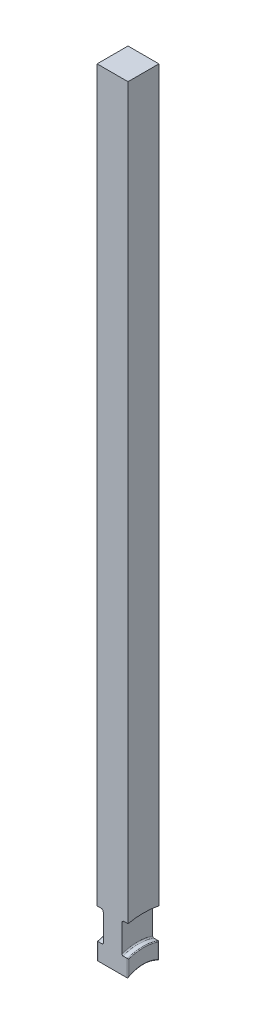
ISO-10303-21;
HEADER;
FILE_DESCRIPTION(('STEP AP214'),'2;1');
FILE_NAME('part.step','',(''),(''),'','','');
FILE_SCHEMA(('AUTOMOTIVE_DESIGN { 1 0 10303 214 1 1 1 1 }'));
ENDSEC;
DATA;
#1=APPLICATION_CONTEXT('core data for automotive mechanical design processes');
#2=APPLICATION_PROTOCOL_DEFINITION('international standard','automotive_design',2000,#1);
#3=PRODUCT_CONTEXT('',#1,'mechanical');
#4=PRODUCT('Part','Part','',(#3));
#5=PRODUCT_RELATED_PRODUCT_CATEGORY('part','',(#4));
#6=PRODUCT_DEFINITION_FORMATION('','',#4);
#7=PRODUCT_DEFINITION_CONTEXT('part definition',#1,'design');
#8=PRODUCT_DEFINITION('design','',#6,#7);
#9=PRODUCT_DEFINITION_SHAPE('','',#8);
#10=(LENGTH_UNIT() NAMED_UNIT(*) SI_UNIT(.MILLI.,.METRE.));
#11=(NAMED_UNIT(*) PLANE_ANGLE_UNIT() SI_UNIT($,.RADIAN.));
#12=(NAMED_UNIT(*) SI_UNIT($,.STERADIAN.) SOLID_ANGLE_UNIT());
#13=UNCERTAINTY_MEASURE_WITH_UNIT(LENGTH_MEASURE(1.E-05),#10,'distance_accuracy_value','');
#14=(GEOMETRIC_REPRESENTATION_CONTEXT(3) GLOBAL_UNCERTAINTY_ASSIGNED_CONTEXT((#13)) GLOBAL_UNIT_ASSIGNED_CONTEXT((#10,
#11,#12)) REPRESENTATION_CONTEXT('',''));
#15=CARTESIAN_POINT('',(0.,0.,0.));
#16=DIRECTION('',(0.,0.,1.));
#17=DIRECTION('',(1.,0.,0.));
#18=AXIS2_PLACEMENT_3D('',#15,#16,#17);
#19=CARTESIAN_POINT('',(5.,260.,5.));
#20=DIRECTION('',(0.,0.,-1.));
#21=DIRECTION('',(0.,1.,0.));
#22=AXIS2_PLACEMENT_3D('',#19,#20,#21);
#23=PLANE('',#22);
#24=DIRECTION('',(1.,0.,0.));
#25=VECTOR('',#24,1.);
#26=CARTESIAN_POINT('',(-5.,8.6602540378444,4.99999999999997));
#27=LINE('',#26,#25);
#28=CARTESIAN_POINT('',(-4.75,8.6602540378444,4.99999999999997));
#29=VERTEX_POINT('',#28);
#30=CARTESIAN_POINT('',(4.75,8.6602540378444,4.99999999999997));
#31=VERTEX_POINT('',#30);
#32=EDGE_CURVE('E212',#29,#31,#27,.T.);
#33=ORIENTED_EDGE('',*,*,#32,.T.);
#34=DIRECTION('',(0.,-1.,0.));
#35=VECTOR('',#34,1.);
#36=CARTESIAN_POINT('',(4.75,260.,5.));
#37=LINE('',#36,#35);
#38=CARTESIAN_POINT('',(4.75,14.142135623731,4.99999999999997));
#39=VERTEX_POINT('',#38);
#40=EDGE_CURVE('E513',#31,#39,#37,.F.);
#41=ORIENTED_EDGE('',*,*,#40,.T.);
#42=DIRECTION('',(-1.,0.,0.));
#43=VECTOR('',#42,1.);
#44=CARTESIAN_POINT('',(-8.84822894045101,14.142135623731,4.99999999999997));
#45=LINE('',#44,#43);
#46=CARTESIAN_POINT('',(3.381,14.142135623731,4.99999999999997));
#47=VERTEX_POINT('',#46);
#48=EDGE_CURVE('E525',#47,#39,#45,.F.);
#49=ORIENTED_EDGE('',*,*,#48,.F.);
#50=CARTESIAN_POINT('',(3.381,14.142135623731,4.99999999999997));
#51=CARTESIAN_POINT('',(3.36044101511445,14.1421123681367,4.99999999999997));
#52=CARTESIAN_POINT('',(3.33989480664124,14.1438990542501,4.99999999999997));
#53=CARTESIAN_POINT('',(3.29944640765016,14.150911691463,4.99999999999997));
#54=CARTESIAN_POINT('',(3.27954279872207,14.1561294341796,4.99999999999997));
#55=CARTESIAN_POINT('',(3.24089644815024,14.1698244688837,4.99999999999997));
#56=CARTESIAN_POINT('',(3.22215359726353,14.1783014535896,4.99999999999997));
#57=CARTESIAN_POINT('',(3.18630692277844,14.1982079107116,4.99999999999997));
#58=CARTESIAN_POINT('',(3.16920356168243,14.2096382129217,4.99999999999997));
#59=CARTESIAN_POINT('',(3.13665043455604,14.2353899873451,4.99999999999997));
#60=CARTESIAN_POINT('',(3.12125112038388,14.2497751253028,4.99999999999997));
#61=CARTESIAN_POINT('',(3.09293401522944,14.2808084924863,4.99999999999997));
#62=CARTESIAN_POINT('',(3.08001687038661,14.2974573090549,4.99999999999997));
#63=CARTESIAN_POINT('',(3.05629123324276,14.3335018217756,4.99999999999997));
#64=CARTESIAN_POINT('',(3.0456345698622,14.3529973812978,4.99999999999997));
#65=CARTESIAN_POINT('',(3.02756329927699,14.393438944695,4.99999999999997));
#66=CARTESIAN_POINT('',(3.02014920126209,14.4143851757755,4.99999999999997));
#67=CARTESIAN_POINT('',(3.00963126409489,14.4536794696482,4.99999999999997));
#68=CARTESIAN_POINT('',(3.00602178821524,14.4718944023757,4.99999999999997));
#69=CARTESIAN_POINT('',(3.00120597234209,14.5086131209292,4.99999999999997));
#70=CARTESIAN_POINT('',(2.99999624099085,14.5271164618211,4.99999999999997));
#71=CARTESIAN_POINT('',(3.,14.5456234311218,4.99999999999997));
#72=B_SPLINE_CURVE_WITH_KNOTS('',3,(#50,#51,#52,#53,#54,#55,#56,#57,#58,#59,#60,#61,#62,#63,#64,
#65,#66,#67,#68,#69,#70,#71),.UNSPECIFIED.,.F.,.F.,(4,2,2,2,2,2,2,2,2,2,4),(0.,
0.061579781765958,0.123012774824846,0.18443997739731,0.245884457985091,0.308826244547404,
0.371784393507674,0.438147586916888,0.504521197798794,0.560074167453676,0.615548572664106),.UNSPECIFIED.);
#73=CARTESIAN_POINT('',(3.,14.5456234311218,4.99999999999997));
#74=VERTEX_POINT('',#73);
#75=EDGE_CURVE('E312',#47,#74,#72,.T.);
#76=ORIENTED_EDGE('',*,*,#75,.T.);
#77=DIRECTION('',(0.,-1.,0.));
#78=VECTOR('',#77,1.);
#79=CARTESIAN_POINT('',(3.,260.,5.));
#80=LINE('',#79,#78);
#81=CARTESIAN_POINT('',(3.,23.2054442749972,4.99999999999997));
#82=VERTEX_POINT('',#81);
#83=EDGE_CURVE('E424',#82,#74,#80,.T.);
#84=ORIENTED_EDGE('',*,*,#83,.F.);
#85=CARTESIAN_POINT('',(3.,23.2054442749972,4.99999999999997));
#86=CARTESIAN_POINT('',(2.99996676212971,23.2499972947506,4.99999999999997));
#87=CARTESIAN_POINT('',(3.00373228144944,23.2945461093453,4.99999999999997));
#88=CARTESIAN_POINT('',(3.01862949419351,23.3823910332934,4.99999999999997));
#89=CARTESIAN_POINT('',(3.02976052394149,23.4256872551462,4.99999999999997));
#90=CARTESIAN_POINT('',(3.05916829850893,23.509822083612,4.99999999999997));
#91=CARTESIAN_POINT('',(3.07745028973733,23.5506588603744,4.99999999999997));
#92=CARTESIAN_POINT('',(3.12067837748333,23.6286229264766,4.99999999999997));
#93=CARTESIAN_POINT('',(3.14562195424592,23.6657516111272,4.99999999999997));
#94=CARTESIAN_POINT('',(3.2012013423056,23.7347915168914,4.99999999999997));
#95=CARTESIAN_POINT('',(3.23177053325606,23.7667563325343,4.99999999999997));
#96=CARTESIAN_POINT('',(3.29795305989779,23.8249730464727,4.99999999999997));
#97=CARTESIAN_POINT('',(3.33356714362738,23.8512240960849,4.99999999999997));
#98=CARTESIAN_POINT('',(3.40801970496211,23.8966720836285,4.99999999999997));
#99=CARTESIAN_POINT('',(3.44677552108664,23.9160046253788,4.99999999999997));
#100=CARTESIAN_POINT('',(3.5270132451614,23.9477326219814,4.99999999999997));
#101=CARTESIAN_POINT('',(3.56849266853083,23.9601343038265,4.99999999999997));
#102=CARTESIAN_POINT('',(3.63558702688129,23.9740235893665,4.99999999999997));
#103=CARTESIAN_POINT('',(3.66073087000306,23.9779013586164,4.99999999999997));
#104=CARTESIAN_POINT('',(3.71124579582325,23.9830736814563,4.99999999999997));
#105=CARTESIAN_POINT('',(3.7366164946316,23.9843719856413,4.99999999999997));
#106=CARTESIAN_POINT('',(3.762,23.9843699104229,4.99999999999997));
#107=B_SPLINE_CURVE_WITH_KNOTS('',3,(#85,#86,#87,#88,#89,#90,#91,#92,#93,#94,#95,#96,#97,#98,
#99,#100,#101,#102,#103,#104,#105,#106),.UNSPECIFIED.,.F.,.F.,(4,2,2,2,2,2,2,2,2,2,4),(0.,
0.133495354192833,0.266978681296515,0.40056012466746,0.53409111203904,0.6661321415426,
0.798192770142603,0.927501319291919,1.05669350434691,1.13289667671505,1.20898896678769),.UNSPECIFIED.);
#108=CARTESIAN_POINT('',(3.762,23.9843699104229,4.99999999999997));
#109=VERTEX_POINT('',#108);
#110=EDGE_CURVE('E277',#82,#109,#107,.T.);
#111=ORIENTED_EDGE('',*,*,#110,.T.);
#112=DIRECTION('',(-1.,0.,0.));
#113=VECTOR('',#112,1.);
#114=CARTESIAN_POINT('',(-8.84822894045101,23.9843699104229,4.99999999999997));
#115=LINE('',#114,#113);
#116=CARTESIAN_POINT('',(5.00000000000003,23.9843699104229,4.99999999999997));
#117=VERTEX_POINT('',#116);
#118=EDGE_CURVE('E482',#117,#109,#115,.T.);
#119=ORIENTED_EDGE('',*,*,#118,.F.);
#120=DIRECTION('',(0.,-1.,0.));
#121=VECTOR('',#120,1.);
#122=CARTESIAN_POINT('',(5.,260.,5.));
#123=LINE('',#122,#121);
#124=CARTESIAN_POINT('',(5.,260.,5.));
#125=VERTEX_POINT('',#124);
#126=EDGE_CURVE('E434',#125,#117,#123,.T.);
#127=ORIENTED_EDGE('',*,*,#126,.F.);
#128=DIRECTION('',(-1.,0.,0.));
#129=VECTOR('',#128,1.);
#130=CARTESIAN_POINT('',(5.,260.,5.));
#131=LINE('',#130,#129);
#132=CARTESIAN_POINT('',(-5.,260.,5.));
#133=VERTEX_POINT('',#132);
#134=EDGE_CURVE('E206',#125,#133,#131,.T.);
#135=ORIENTED_EDGE('',*,*,#134,.T.);
#136=DIRECTION('',(0.,-1.,0.));
#137=VECTOR('',#136,1.);
#138=CARTESIAN_POINT('',(-5.,260.,5.));
#139=LINE('',#138,#137);
#140=CARTESIAN_POINT('',(-5.00000000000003,23.9843699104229,4.99999999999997));
#141=VERTEX_POINT('',#140);
#142=EDGE_CURVE('E198',#133,#141,#139,.T.);
#143=ORIENTED_EDGE('',*,*,#142,.T.);
#144=DIRECTION('',(-1.,0.,0.));
#145=VECTOR('',#144,1.);
#146=CARTESIAN_POINT('',(-8.84822894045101,23.9843699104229,4.99999999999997));
#147=LINE('',#146,#145);
#148=CARTESIAN_POINT('',(-3.762,23.9843699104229,4.99999999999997));
#149=VERTEX_POINT('',#148);
#150=EDGE_CURVE('E179',#149,#141,#147,.T.);
#151=ORIENTED_EDGE('',*,*,#150,.F.);
#152=CARTESIAN_POINT('',(-3.762,23.9843699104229,4.99999999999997));
#153=CARTESIAN_POINT('',(-3.71978958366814,23.9844099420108,4.99999999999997));
#154=CARTESIAN_POINT('',(-3.67759522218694,23.9807897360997,4.99999999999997));
#155=CARTESIAN_POINT('',(-3.59446661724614,23.9665304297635,4.99999999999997));
#156=CARTESIAN_POINT('',(-3.55353072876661,23.9559009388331,4.99999999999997));
#157=CARTESIAN_POINT('',(-3.47401404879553,23.9279192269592,4.99999999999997));
#158=CARTESIAN_POINT('',(-3.4354339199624,23.9105651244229,4.99999999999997));
#159=CARTESIAN_POINT('',(-3.36170074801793,23.8696860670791,4.99999999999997));
#160=CARTESIAN_POINT('',(-3.32654766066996,23.846161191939,4.99999999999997));
#161=CARTESIAN_POINT('',(-3.26030425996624,23.7934071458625,4.99999999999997));
#162=CARTESIAN_POINT('',(-3.22925316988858,23.7641287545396,4.99999999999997));
#163=CARTESIAN_POINT('',(-3.17238517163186,23.7008610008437,4.99999999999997));
#164=CARTESIAN_POINT('',(-3.14656943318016,23.6668705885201,4.99999999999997));
#165=CARTESIAN_POINT('',(-3.10035493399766,23.5944221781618,4.99999999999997));
#166=CARTESIAN_POINT('',(-3.0800757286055,23.5558879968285,4.99999999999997));
#167=CARTESIAN_POINT('',(-3.04613526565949,23.4760125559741,4.99999999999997));
#168=CARTESIAN_POINT('',(-3.03247223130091,23.4346720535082,4.99999999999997));
#169=CARTESIAN_POINT('',(-3.01487304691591,23.3618958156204,4.99999999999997));
#170=CARTESIAN_POINT('',(-3.0092983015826,23.3308452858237,4.99999999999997));
#171=CARTESIAN_POINT('',(-3.00186183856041,23.2683479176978,4.99999999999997));
#172=CARTESIAN_POINT('',(-2.9999948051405,23.2369017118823,4.99999999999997));
#173=CARTESIAN_POINT('',(-3.,23.2054442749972,4.99999999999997));
#174=B_SPLINE_CURVE_WITH_KNOTS('',3,(#152,#153,#154,#155,#156,#157,#158,#159,#160,#161,#162,
#163,#164,#165,#166,#167,#168,#169,#170,#171,#172,#173),.UNSPECIFIED.,.F.,.F.,(4,2,2,2,2,2,2,2,
2,2,4),(0.,0.126452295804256,0.25273158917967,0.379046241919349,0.50535926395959,
0.632804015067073,0.760277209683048,0.89031743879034,1.02032272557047,1.11475319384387,
1.20904817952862),.UNSPECIFIED.);
#175=CARTESIAN_POINT('',(-3.,23.2054442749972,4.99999999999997));
#176=VERTEX_POINT('',#175);
#177=EDGE_CURVE('E243',#149,#176,#174,.T.);
#178=ORIENTED_EDGE('',*,*,#177,.T.);
#179=DIRECTION('',(0.,1.,0.));
#180=VECTOR('',#179,1.);
#181=CARTESIAN_POINT('',(-3.,260.,5.));
#182=LINE('',#181,#180);
#183=CARTESIAN_POINT('',(-3.,14.5456234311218,4.99999999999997));
#184=VERTEX_POINT('',#183);
#185=EDGE_CURVE('E428',#184,#176,#182,.T.);
#186=ORIENTED_EDGE('',*,*,#185,.F.);
#187=CARTESIAN_POINT('',(-3.,14.5456234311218,4.99999999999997));
#188=CARTESIAN_POINT('',(-2.99998669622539,14.521929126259,4.99999999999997));
#189=CARTESIAN_POINT('',(-3.00197620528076,14.4982335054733,4.99999999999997));
#190=CARTESIAN_POINT('',(-3.00986486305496,14.4514801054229,4.99999999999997));
#191=CARTESIAN_POINT('',(-3.01576760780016,14.4284229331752,4.99999999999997));
#192=CARTESIAN_POINT('',(-3.03139415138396,14.3836107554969,4.99999999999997));
#193=CARTESIAN_POINT('',(-3.04112173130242,14.3618570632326,4.99999999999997));
#194=CARTESIAN_POINT('',(-3.06418438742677,14.3203644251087,4.99999999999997));
#195=CARTESIAN_POINT('',(-3.07751717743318,14.3006242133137,4.99999999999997));
#196=CARTESIAN_POINT('',(-3.10707013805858,14.2643232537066,4.99999999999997));
#197=CARTESIAN_POINT('',(-3.12320168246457,14.2476904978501,4.99999999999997));
#198=CARTESIAN_POINT('',(-3.15817938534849,14.2175591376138,4.99999999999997));
#199=CARTESIAN_POINT('',(-3.17702556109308,14.2040605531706,4.99999999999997));
#200=CARTESIAN_POINT('',(-3.21576938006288,14.1813954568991,4.99999999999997));
#201=CARTESIAN_POINT('',(-3.23555118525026,14.1720306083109,4.99999999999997));
#202=CARTESIAN_POINT('',(-3.27645260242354,14.1569716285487,4.99999999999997));
#203=CARTESIAN_POINT('',(-3.29757019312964,14.1512720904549,4.99999999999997));
#204=CARTESIAN_POINT('',(-3.32924424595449,14.145729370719,4.99999999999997));
#205=CARTESIAN_POINT('',(-3.33955687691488,14.1443822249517,4.99999999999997));
#206=CARTESIAN_POINT('',(-3.36024450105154,14.1425859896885,4.99999999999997));
#207=CARTESIAN_POINT('',(-3.37061937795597,14.1421355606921,4.99999999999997));
#208=CARTESIAN_POINT('',(-3.38099999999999,14.1421356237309,4.99999999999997));
#209=B_SPLINE_CURVE_WITH_KNOTS('',3,(#187,#188,#189,#190,#191,#192,#193,#194,#195,#196,#197,
#198,#199,#200,#201,#202,#203,#204,#205,#206,#207,#208),.UNSPECIFIED.,.F.,.F.,(4,2,2,2,2,2,2,2,
2,2,4),(0.,0.0710029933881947,0.14207132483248,0.213210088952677,0.284303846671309,
0.353459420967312,0.422615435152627,0.487945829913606,0.553179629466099,0.584346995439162,
0.615467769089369),.UNSPECIFIED.);
#210=CARTESIAN_POINT('',(-3.381,14.142135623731,4.99999999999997));
#211=VERTEX_POINT('',#210);
#212=EDGE_CURVE('E292',#184,#211,#209,.T.);
#213=ORIENTED_EDGE('',*,*,#212,.T.);
#214=DIRECTION('',(-1.,0.,0.));
#215=VECTOR('',#214,1.);
#216=CARTESIAN_POINT('',(-8.84822894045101,14.142135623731,4.99999999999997));
#217=LINE('',#216,#215);
#218=CARTESIAN_POINT('',(-4.75,14.142135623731,4.99999999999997));
#219=VERTEX_POINT('',#218);
#220=EDGE_CURVE('E509',#219,#211,#217,.F.);
#221=ORIENTED_EDGE('',*,*,#220,.F.);
#222=DIRECTION('',(0.,-1.,0.));
#223=VECTOR('',#222,1.);
#224=CARTESIAN_POINT('',(-4.75,8.66025403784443,4.99999999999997));
#225=LINE('',#224,#223);
#226=EDGE_CURVE('E510',#219,#29,#225,.T.);
#227=ORIENTED_EDGE('',*,*,#226,.T.);
#228=EDGE_LOOP('',(#33,#41,#49,#76,#84,#111,#119,#127,#135,#143,#151,#178,#186,#213,#221,#227));
#229=FACE_BOUND('',#228,.T.);
#230=ADVANCED_FACE('F37',(#229),#23,.F.);
#231=CARTESIAN_POINT('',(5.,260.,-5.));
#232=DIRECTION('',(0.,0.,1.));
#233=DIRECTION('',(0.,-1.,0.));
#234=AXIS2_PLACEMENT_3D('',#231,#232,#233);
#235=PLANE('',#234);
#236=DIRECTION('',(-1.,0.,0.));
#237=VECTOR('',#236,1.);
#238=CARTESIAN_POINT('',(-8.84822894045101,14.1421356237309,-5.00000000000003));
#239=LINE('',#238,#237);
#240=CARTESIAN_POINT('',(4.75,14.1421356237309,-5.00000000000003));
#241=VERTEX_POINT('',#240);
#242=CARTESIAN_POINT('',(3.381,14.1421356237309,-5.00000000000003));
#243=VERTEX_POINT('',#242);
#244=EDGE_CURVE('E484',#241,#243,#239,.T.);
#245=ORIENTED_EDGE('',*,*,#244,.F.);
#246=DIRECTION('',(0.,1.,0.));
#247=VECTOR('',#246,1.);
#248=CARTESIAN_POINT('',(4.75,260.,-5.));
#249=LINE('',#248,#247);
#250=CARTESIAN_POINT('',(4.75,8.66025403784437,-5.00000000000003));
#251=VERTEX_POINT('',#250);
#252=EDGE_CURVE('E411',#241,#251,#249,.F.);
#253=ORIENTED_EDGE('',*,*,#252,.T.);
#254=DIRECTION('',(1.,0.,0.));
#255=VECTOR('',#254,1.);
#256=CARTESIAN_POINT('',(-5.,8.66025403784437,-5.00000000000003));
#257=LINE('',#256,#255);
#258=CARTESIAN_POINT('',(-4.75,8.66025403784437,-5.00000000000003));
#259=VERTEX_POINT('',#258);
#260=EDGE_CURVE('E418',#251,#259,#257,.F.);
#261=ORIENTED_EDGE('',*,*,#260,.T.);
#262=DIRECTION('',(0.,1.,0.));
#263=VECTOR('',#262,1.);
#264=CARTESIAN_POINT('',(-4.75,14.1421356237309,-5.00000000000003));
#265=LINE('',#264,#263);
#266=CARTESIAN_POINT('',(-4.75,14.1421356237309,-5.00000000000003));
#267=VERTEX_POINT('',#266);
#268=EDGE_CURVE('E406',#259,#267,#265,.T.);
#269=ORIENTED_EDGE('',*,*,#268,.T.);
#270=DIRECTION('',(-1.,0.,0.));
#271=VECTOR('',#270,1.);
#272=CARTESIAN_POINT('',(-8.84822894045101,14.1421356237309,-5.00000000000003));
#273=LINE('',#272,#271);
#274=CARTESIAN_POINT('',(-3.381,14.1421356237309,-5.00000000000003));
#275=VERTEX_POINT('',#274);
#276=EDGE_CURVE('E495',#275,#267,#273,.T.);
#277=ORIENTED_EDGE('',*,*,#276,.F.);
#278=CARTESIAN_POINT('',(-3.381,14.1421356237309,-5.00000000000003));
#279=CARTESIAN_POINT('',(-3.36044101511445,14.1421123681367,-5.00000000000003));
#280=CARTESIAN_POINT('',(-3.33989480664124,14.1438990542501,-5.00000000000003));
#281=CARTESIAN_POINT('',(-3.29944640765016,14.150911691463,-5.00000000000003));
#282=CARTESIAN_POINT('',(-3.27954279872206,14.1561294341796,-5.00000000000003));
#283=CARTESIAN_POINT('',(-3.24089644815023,14.1698244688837,-5.00000000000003));
#284=CARTESIAN_POINT('',(-3.22215359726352,14.1783014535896,-5.00000000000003));
#285=CARTESIAN_POINT('',(-3.18630692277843,14.1982079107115,-5.00000000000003));
#286=CARTESIAN_POINT('',(-3.16920356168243,14.2096382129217,-5.00000000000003));
#287=CARTESIAN_POINT('',(-3.13665043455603,14.2353899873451,-5.00000000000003));
#288=CARTESIAN_POINT('',(-3.12125112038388,14.2497751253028,-5.00000000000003));
#289=CARTESIAN_POINT('',(-3.09293401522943,14.2808084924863,-5.00000000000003));
#290=CARTESIAN_POINT('',(-3.08001687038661,14.2974573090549,-5.00000000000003));
#291=CARTESIAN_POINT('',(-3.05629123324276,14.3335018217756,-5.00000000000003));
#292=CARTESIAN_POINT('',(-3.0456345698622,14.3529973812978,-5.00000000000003));
#293=CARTESIAN_POINT('',(-3.02756329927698,14.3934389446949,-5.00000000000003));
#294=CARTESIAN_POINT('',(-3.02014920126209,14.4143851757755,-5.00000000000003));
#295=CARTESIAN_POINT('',(-3.00963126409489,14.4536794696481,-5.00000000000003));
#296=CARTESIAN_POINT('',(-3.00602178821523,14.4718944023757,-5.00000000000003));
#297=CARTESIAN_POINT('',(-3.00120597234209,14.5086131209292,-5.00000000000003));
#298=CARTESIAN_POINT('',(-2.99999624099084,14.5271164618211,-5.00000000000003));
#299=CARTESIAN_POINT('',(-3.,14.5456234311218,-5.00000000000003));
#300=B_SPLINE_CURVE_WITH_KNOTS('',3,(#278,#279,#280,#281,#282,#283,#284,#285,#286,#287,#288,
#289,#290,#291,#292,#293,#294,#295,#296,#297,#298,#299),.UNSPECIFIED.,.F.,.F.,(4,2,2,2,2,2,2,2,
2,2,4),(0.,0.0615797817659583,0.123012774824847,0.184439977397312,0.245884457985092,
0.308826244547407,0.371784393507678,0.43814758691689,0.504521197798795,0.56007416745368,
0.615548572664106),.UNSPECIFIED.);
#301=CARTESIAN_POINT('',(-3.,14.5456234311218,-5.00000000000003));
#302=VERTEX_POINT('',#301);
#303=EDGE_CURVE('E301',#275,#302,#300,.T.);
#304=ORIENTED_EDGE('',*,*,#303,.T.);
#305=DIRECTION('',(0.,-1.,0.));
#306=VECTOR('',#305,1.);
#307=CARTESIAN_POINT('',(-3.,260.,-5.));
#308=LINE('',#307,#306);
#309=CARTESIAN_POINT('',(-3.,23.2054442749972,-5.00000000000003));
#310=VERTEX_POINT('',#309);
#311=EDGE_CURVE('E221',#310,#302,#308,.T.);
#312=ORIENTED_EDGE('',*,*,#311,.F.);
#313=CARTESIAN_POINT('',(-3.,23.2054442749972,-5.00000000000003));
#314=CARTESIAN_POINT('',(-2.99996676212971,23.2499972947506,-5.00000000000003));
#315=CARTESIAN_POINT('',(-3.00373228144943,23.2945461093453,-5.00000000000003));
#316=CARTESIAN_POINT('',(-3.01862949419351,23.3823910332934,-5.00000000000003));
#317=CARTESIAN_POINT('',(-3.02976052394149,23.4256872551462,-5.00000000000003));
#318=CARTESIAN_POINT('',(-3.05916829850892,23.509822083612,-5.00000000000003));
#319=CARTESIAN_POINT('',(-3.07745028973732,23.5506588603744,-5.00000000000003));
#320=CARTESIAN_POINT('',(-3.12067837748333,23.6286229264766,-5.00000000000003));
#321=CARTESIAN_POINT('',(-3.14562195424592,23.6657516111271,-5.00000000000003));
#322=CARTESIAN_POINT('',(-3.20120134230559,23.7347915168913,-5.00000000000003));
#323=CARTESIAN_POINT('',(-3.23177053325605,23.7667563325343,-5.00000000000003));
#324=CARTESIAN_POINT('',(-3.29795305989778,23.8249730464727,-5.00000000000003));
#325=CARTESIAN_POINT('',(-3.33356714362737,23.8512240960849,-5.00000000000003));
#326=CARTESIAN_POINT('',(-3.4080197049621,23.8966720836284,-5.00000000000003));
#327=CARTESIAN_POINT('',(-3.44677552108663,23.9160046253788,-5.00000000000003));
#328=CARTESIAN_POINT('',(-3.5270132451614,23.9477326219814,-5.00000000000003));
#329=CARTESIAN_POINT('',(-3.56849266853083,23.9601343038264,-5.00000000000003));
#330=CARTESIAN_POINT('',(-3.63558702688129,23.9740235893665,-5.00000000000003));
#331=CARTESIAN_POINT('',(-3.66073087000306,23.9779013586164,-5.00000000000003));
#332=CARTESIAN_POINT('',(-3.71124579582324,23.9830736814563,-5.00000000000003));
#333=CARTESIAN_POINT('',(-3.7366164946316,23.9843719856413,-5.00000000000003));
#334=CARTESIAN_POINT('',(-3.762,23.9843699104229,-5.00000000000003));
#335=B_SPLINE_CURVE_WITH_KNOTS('',3,(#313,#314,#315,#316,#317,#318,#319,#320,#321,#322,#323,
#324,#325,#326,#327,#328,#329,#330,#331,#332,#333,#334),.UNSPECIFIED.,.F.,.F.,(4,2,2,2,2,2,2,2,
2,2,4),(0.,0.133495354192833,0.266978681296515,0.400560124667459,0.534091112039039,
0.666132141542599,0.7981927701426,0.927501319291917,1.05669350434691,1.13289667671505,
1.20898896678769),.UNSPECIFIED.);
#336=CARTESIAN_POINT('',(-3.762,23.9843699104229,-5.00000000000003));
#337=VERTEX_POINT('',#336);
#338=EDGE_CURVE('E235',#310,#337,#335,.T.);
#339=ORIENTED_EDGE('',*,*,#338,.T.);
#340=DIRECTION('',(-1.,0.,0.));
#341=VECTOR('',#340,1.);
#342=CARTESIAN_POINT('',(-8.84822894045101,23.9843699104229,-5.00000000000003));
#343=LINE('',#342,#341);
#344=CARTESIAN_POINT('',(-5.00000000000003,23.9843699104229,-5.00000000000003));
#345=VERTEX_POINT('',#344);
#346=EDGE_CURVE('E192',#345,#337,#343,.F.);
#347=ORIENTED_EDGE('',*,*,#346,.F.);
#348=DIRECTION('',(0.,1.,0.));
#349=VECTOR('',#348,1.);
#350=CARTESIAN_POINT('',(-5.,260.,-5.));
#351=LINE('',#350,#349);
#352=CARTESIAN_POINT('',(-5.,260.,-5.));
#353=VERTEX_POINT('',#352);
#354=EDGE_CURVE('E200',#345,#353,#351,.T.);
#355=ORIENTED_EDGE('',*,*,#354,.T.);
#356=DIRECTION('',(-1.,0.,0.));
#357=VECTOR('',#356,1.);
#358=CARTESIAN_POINT('',(5.,260.,-5.));
#359=LINE('',#358,#357);
#360=CARTESIAN_POINT('',(5.,260.,-5.));
#361=VERTEX_POINT('',#360);
#362=EDGE_CURVE('E216',#361,#353,#359,.T.);
#363=ORIENTED_EDGE('',*,*,#362,.F.);
#364=DIRECTION('',(0.,1.,0.));
#365=VECTOR('',#364,1.);
#366=CARTESIAN_POINT('',(5.,260.,-5.));
#367=LINE('',#366,#365);
#368=CARTESIAN_POINT('',(5.,23.9843699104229,-5.00000000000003));
#369=VERTEX_POINT('',#368);
#370=EDGE_CURVE('E219',#369,#361,#367,.T.);
#371=ORIENTED_EDGE('',*,*,#370,.F.);
#372=DIRECTION('',(-1.,0.,0.));
#373=VECTOR('',#372,1.);
#374=CARTESIAN_POINT('',(-8.84822894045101,23.9843699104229,-5.00000000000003));
#375=LINE('',#374,#373);
#376=CARTESIAN_POINT('',(3.762,23.9843699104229,-5.00000000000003));
#377=VERTEX_POINT('',#376);
#378=EDGE_CURVE('E191',#377,#369,#375,.F.);
#379=ORIENTED_EDGE('',*,*,#378,.F.);
#380=CARTESIAN_POINT('',(3.762,23.9843699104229,-5.00000000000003));
#381=CARTESIAN_POINT('',(3.71978958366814,23.9844099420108,-5.00000000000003));
#382=CARTESIAN_POINT('',(3.67759522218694,23.9807897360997,-5.00000000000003));
#383=CARTESIAN_POINT('',(3.59446661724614,23.9665304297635,-5.00000000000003));
#384=CARTESIAN_POINT('',(3.55353072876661,23.9559009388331,-5.00000000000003));
#385=CARTESIAN_POINT('',(3.47401404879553,23.9279192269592,-5.00000000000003));
#386=CARTESIAN_POINT('',(3.4354339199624,23.9105651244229,-5.00000000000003));
#387=CARTESIAN_POINT('',(3.36170074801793,23.869686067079,-5.00000000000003));
#388=CARTESIAN_POINT('',(3.32654766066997,23.846161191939,-5.00000000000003));
#389=CARTESIAN_POINT('',(3.26030425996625,23.7934071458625,-5.00000000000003));
#390=CARTESIAN_POINT('',(3.22925316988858,23.7641287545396,-5.00000000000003));
#391=CARTESIAN_POINT('',(3.17238517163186,23.7008610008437,-5.00000000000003));
#392=CARTESIAN_POINT('',(3.14656943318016,23.6668705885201,-5.00000000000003));
#393=CARTESIAN_POINT('',(3.10035493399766,23.5944221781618,-5.00000000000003));
#394=CARTESIAN_POINT('',(3.0800757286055,23.5558879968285,-5.00000000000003));
#395=CARTESIAN_POINT('',(3.04613526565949,23.4760125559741,-5.00000000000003));
#396=CARTESIAN_POINT('',(3.03247223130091,23.4346720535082,-5.00000000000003));
#397=CARTESIAN_POINT('',(3.01487304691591,23.3618958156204,-5.00000000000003));
#398=CARTESIAN_POINT('',(3.0092983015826,23.3308452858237,-5.00000000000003));
#399=CARTESIAN_POINT('',(3.00186183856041,23.2683479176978,-5.00000000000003));
#400=CARTESIAN_POINT('',(2.9999948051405,23.2369017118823,-5.00000000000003));
#401=CARTESIAN_POINT('',(3.,23.2054442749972,-5.00000000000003));
#402=B_SPLINE_CURVE_WITH_KNOTS('',3,(#380,#381,#382,#383,#384,#385,#386,#387,#388,#389,#390,
#391,#392,#393,#394,#395,#396,#397,#398,#399,#400,#401),.UNSPECIFIED.,.F.,.F.,(4,2,2,2,2,2,2,2,
2,2,4),(0.,0.126452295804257,0.252731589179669,0.379046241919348,0.505359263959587,
0.63280401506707,0.760277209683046,0.890317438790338,1.02032272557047,1.11475319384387,
1.20904817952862),.UNSPECIFIED.);
#403=CARTESIAN_POINT('',(3.,23.2054442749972,-5.00000000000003));
#404=VERTEX_POINT('',#403);
#405=EDGE_CURVE('E271',#377,#404,#402,.T.);
#406=ORIENTED_EDGE('',*,*,#405,.T.);
#407=DIRECTION('',(0.,1.,0.));
#408=VECTOR('',#407,1.);
#409=CARTESIAN_POINT('',(3.,260.,-5.));
#410=LINE('',#409,#408);
#411=CARTESIAN_POINT('',(3.,14.5456234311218,-5.00000000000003));
#412=VERTEX_POINT('',#411);
#413=EDGE_CURVE('E224',#412,#404,#410,.T.);
#414=ORIENTED_EDGE('',*,*,#413,.F.);
#415=CARTESIAN_POINT('',(3.,14.5456234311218,-5.00000000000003));
#416=CARTESIAN_POINT('',(2.9999866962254,14.521929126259,-5.00000000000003));
#417=CARTESIAN_POINT('',(3.00197620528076,14.4982335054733,-5.00000000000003));
#418=CARTESIAN_POINT('',(3.00986486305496,14.4514801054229,-5.00000000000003));
#419=CARTESIAN_POINT('',(3.01576760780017,14.4284229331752,-5.00000000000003));
#420=CARTESIAN_POINT('',(3.03139415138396,14.3836107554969,-5.00000000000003));
#421=CARTESIAN_POINT('',(3.04112173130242,14.3618570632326,-5.00000000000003));
#422=CARTESIAN_POINT('',(3.06418438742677,14.3203644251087,-5.00000000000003));
#423=CARTESIAN_POINT('',(3.07751717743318,14.3006242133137,-5.00000000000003));
#424=CARTESIAN_POINT('',(3.10707013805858,14.2643232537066,-5.00000000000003));
#425=CARTESIAN_POINT('',(3.12320168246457,14.2476904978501,-5.00000000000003));
#426=CARTESIAN_POINT('',(3.1581793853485,14.2175591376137,-5.00000000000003));
#427=CARTESIAN_POINT('',(3.17702556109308,14.2040605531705,-5.00000000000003));
#428=CARTESIAN_POINT('',(3.21576938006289,14.1813954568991,-5.00000000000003));
#429=CARTESIAN_POINT('',(3.23555118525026,14.1720306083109,-5.00000000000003));
#430=CARTESIAN_POINT('',(3.27645260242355,14.1569716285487,-5.00000000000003));
#431=CARTESIAN_POINT('',(3.29757019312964,14.1512720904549,-5.00000000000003));
#432=CARTESIAN_POINT('',(3.3292442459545,14.145729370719,-5.00000000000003));
#433=CARTESIAN_POINT('',(3.33955687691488,14.1443822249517,-5.00000000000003));
#434=CARTESIAN_POINT('',(3.36024450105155,14.1425859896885,-5.00000000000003));
#435=CARTESIAN_POINT('',(3.37061937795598,14.1421355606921,-5.00000000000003));
#436=CARTESIAN_POINT('',(3.38099999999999,14.1421356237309,-5.00000000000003));
#437=B_SPLINE_CURVE_WITH_KNOTS('',3,(#415,#416,#417,#418,#419,#420,#421,#422,#423,#424,#425,
#426,#427,#428,#429,#430,#431,#432,#433,#434,#435,#436),.UNSPECIFIED.,.F.,.F.,(4,2,2,2,2,2,2,2,
2,2,4),(0.,0.0710029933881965,0.14207132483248,0.213210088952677,0.284303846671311,
0.353459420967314,0.422615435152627,0.487945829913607,0.553179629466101,0.584346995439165,
0.615467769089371),.UNSPECIFIED.);
#438=EDGE_CURVE('E300',#412,#243,#437,.T.);
#439=ORIENTED_EDGE('',*,*,#438,.T.);
#440=EDGE_LOOP('',(#245,#253,#261,#269,#277,#304,#312,#339,#347,#355,#363,#371,#379,#406,#414,#439));
#441=FACE_BOUND('',#440,.T.);
#442=ADVANCED_FACE('F250',(#441),#235,.F.);
#443=CARTESIAN_POINT('',(5.,0.,0.));
#444=DIRECTION('',(-1.,0.,0.));
#445=DIRECTION('',(0.,0.,1.));
#446=AXIS2_PLACEMENT_3D('',#443,#444,#445);
#447=PLANE('',#446);
#448=CARTESIAN_POINT('',(5.,0.,0.));
#449=DIRECTION('',(-1.,0.,0.));
#450=DIRECTION('',(0.,0.,1.));
#451=AXIS2_PLACEMENT_3D('',#448,#449,#450);
#452=CIRCLE('',#451,10.25);
#453=CARTESIAN_POINT('',(5.,9.08295106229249,4.74999999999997));
#454=VERTEX_POINT('',#453);
#455=CARTESIAN_POINT('',(5.,9.08295106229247,-4.75000000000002));
#456=VERTEX_POINT('',#455);
#457=EDGE_CURVE('E542',#454,#456,#452,.T.);
#458=ORIENTED_EDGE('',*,*,#457,.T.);
#459=DIRECTION('',(0.,1.,0.));
#460=VECTOR('',#459,1.);
#461=CARTESIAN_POINT('',(5.,0.,-4.75000000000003));
#462=LINE('',#461,#460);
#463=CARTESIAN_POINT('',(5.,13.9642400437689,-4.75000000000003));
#464=VERTEX_POINT('',#463);
#465=EDGE_CURVE('E412',#456,#464,#462,.T.);
#466=ORIENTED_EDGE('',*,*,#465,.T.);
#467=CARTESIAN_POINT('',(5.,0.,0.));
#468=DIRECTION('',(-1.,0.,0.));
#469=DIRECTION('',(0.,0.,1.));
#470=AXIS2_PLACEMENT_3D('',#467,#468,#469);
#471=CIRCLE('',#470,14.75);
#472=CARTESIAN_POINT('',(5.,13.9642400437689,4.74999999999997));
#473=VERTEX_POINT('',#472);
#474=EDGE_CURVE('E536',#464,#473,#471,.F.);
#475=ORIENTED_EDGE('',*,*,#474,.T.);
#476=DIRECTION('',(0.,-1.,0.));
#477=VECTOR('',#476,1.);
#478=CARTESIAN_POINT('',(5.,0.,4.74999999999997));
#479=LINE('',#478,#477);
#480=EDGE_CURVE('E540',#473,#454,#479,.T.);
#481=ORIENTED_EDGE('',*,*,#480,.T.);
#482=EDGE_LOOP('',(#458,#466,#475,#481));
#483=FACE_BOUND('',#482,.T.);
#484=ADVANCED_FACE('F451',(#483),#447,.F.);
#485=CARTESIAN_POINT('',(-5.,0.,0.));
#486=DIRECTION('',(-1.,0.,0.));
#487=DIRECTION('',(0.,0.,1.));
#488=AXIS2_PLACEMENT_3D('',#485,#486,#487);
#489=PLANE('',#488);
#490=ORIENTED_EDGE('',*,*,#354,.F.);
#491=CARTESIAN_POINT('',(-5.00000000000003,0.,0.));
#492=DIRECTION('',(-1.,0.,0.));
#493=DIRECTION('',(0.,0.,1.));
#494=AXIS2_PLACEMENT_3D('',#491,#492,#493);
#495=CIRCLE('',#494,24.5);
#496=EDGE_CURVE('E183',#141,#345,#495,.T.);
#497=ORIENTED_EDGE('',*,*,#496,.F.);
#498=ORIENTED_EDGE('',*,*,#142,.F.);
#499=DIRECTION('',(0.,0.,1.));
#500=VECTOR('',#499,1.);
#501=CARTESIAN_POINT('',(-5.,260.,5.));
#502=LINE('',#501,#500);
#503=EDGE_CURVE('E208',#353,#133,#502,.T.);
#504=ORIENTED_EDGE('',*,*,#503,.F.);
#505=EDGE_LOOP('',(#490,#497,#498,#504));
#506=FACE_BOUND('',#505,.T.);
#507=ADVANCED_FACE('F196',(#506),#489,.T.);
#508=DIRECTION('',(0.,1.,0.));
#509=VECTOR('',#508,1.);
#510=CARTESIAN_POINT('',(-5.,8.66025403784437,-4.75000000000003));
#511=LINE('',#510,#509);
#512=CARTESIAN_POINT('',(-5.,13.9642400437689,-4.75000000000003));
#513=VERTEX_POINT('',#512);
#514=CARTESIAN_POINT('',(-5.,9.08295106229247,-4.75000000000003));
#515=VERTEX_POINT('',#514);
#516=EDGE_CURVE('E59',#513,#515,#511,.F.);
#517=ORIENTED_EDGE('',*,*,#516,.T.);
#518=CARTESIAN_POINT('',(-5.,0.,0.));
#519=DIRECTION('',(-1.,0.,0.));
#520=DIRECTION('',(0.,0.,1.));
#521=AXIS2_PLACEMENT_3D('',#518,#519,#520);
#522=CIRCLE('',#521,10.25);
#523=CARTESIAN_POINT('',(-5.,9.08295106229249,4.74999999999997));
#524=VERTEX_POINT('',#523);
#525=EDGE_CURVE('E51',#515,#524,#522,.F.);
#526=ORIENTED_EDGE('',*,*,#525,.T.);
#527=DIRECTION('',(0.,-1.,0.));
#528=VECTOR('',#527,1.);
#529=CARTESIAN_POINT('',(-5.,14.142135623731,4.74999999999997));
#530=LINE('',#529,#528);
#531=CARTESIAN_POINT('',(-5.,13.9642400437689,4.74999999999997));
#532=VERTEX_POINT('',#531);
#533=EDGE_CURVE('E520',#524,#532,#530,.F.);
#534=ORIENTED_EDGE('',*,*,#533,.T.);
#535=CARTESIAN_POINT('',(-5.,0.,0.));
#536=DIRECTION('',(-1.,0.,0.));
#537=DIRECTION('',(0.,0.,1.));
#538=AXIS2_PLACEMENT_3D('',#535,#536,#537);
#539=CIRCLE('',#538,14.75);
#540=EDGE_CURVE('E64',#532,#513,#539,.T.);
#541=ORIENTED_EDGE('',*,*,#540,.T.);
#542=EDGE_LOOP('',(#517,#526,#534,#541));
#543=FACE_BOUND('',#542,.T.);
#544=ADVANCED_FACE('F445',(#543),#489,.T.);
#545=CARTESIAN_POINT('',(5.,260.,5.));
#546=DIRECTION('',(0.,-1.,0.));
#547=DIRECTION('',(0.,0.,-1.));
#548=AXIS2_PLACEMENT_3D('',#545,#546,#547);
#549=PLANE('',#548);
#550=ORIENTED_EDGE('',*,*,#503,.T.);
#551=ORIENTED_EDGE('',*,*,#134,.F.);
#552=DIRECTION('',(0.,0.,1.));
#553=VECTOR('',#552,1.);
#554=CARTESIAN_POINT('',(5.,260.,5.));
#555=LINE('',#554,#553);
#556=EDGE_CURVE('E210',#361,#125,#555,.T.);
#557=ORIENTED_EDGE('',*,*,#556,.F.);
#558=ORIENTED_EDGE('',*,*,#362,.T.);
#559=EDGE_LOOP('',(#550,#551,#557,#558));
#560=FACE_BOUND('',#559,.T.);
#561=ADVANCED_FACE('F261',(#560),#549,.F.);
#562=CARTESIAN_POINT('',(5.00000000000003,0.,0.));
#563=DIRECTION('',(-1.,0.,0.));
#564=DIRECTION('',(0.,0.,1.));
#565=AXIS2_PLACEMENT_3D('',#562,#563,#564);
#566=CIRCLE('',#565,24.5);
#567=EDGE_CURVE('E201',#117,#369,#566,.T.);
#568=ORIENTED_EDGE('',*,*,#567,.T.);
#569=ORIENTED_EDGE('',*,*,#370,.T.);
#570=ORIENTED_EDGE('',*,*,#556,.T.);
#571=ORIENTED_EDGE('',*,*,#126,.T.);
#572=EDGE_LOOP('',(#568,#569,#570,#571));
#573=FACE_BOUND('',#572,.T.);
#574=ADVANCED_FACE('F440',(#573),#447,.F.);
#575=CARTESIAN_POINT('',(-5.,0.,0.));
#576=DIRECTION('',(1.,0.,0.));
#577=DIRECTION('',(0.,0.,-1.));
#578=AXIS2_PLACEMENT_3D('',#575,#576,#577);
#579=CYLINDRICAL_SURFACE('',#578,10.);
#580=ORIENTED_EDGE('',*,*,#260,.F.);
#581=CARTESIAN_POINT('',(4.75,0.,0.));
#582=DIRECTION('',(-1.,0.,0.));
#583=DIRECTION('',(0.,0.,1.));
#584=AXIS2_PLACEMENT_3D('',#581,#582,#583);
#585=CIRCLE('',#584,10.);
#586=EDGE_CURVE('E419',#251,#31,#585,.F.);
#587=ORIENTED_EDGE('',*,*,#586,.T.);
#588=ORIENTED_EDGE('',*,*,#32,.F.);
#589=CARTESIAN_POINT('',(-4.75,0.,0.));
#590=DIRECTION('',(-1.,0.,0.));
#591=DIRECTION('',(0.,0.,1.));
#592=AXIS2_PLACEMENT_3D('',#589,#590,#591);
#593=CIRCLE('',#592,10.);
#594=EDGE_CURVE('E403',#29,#259,#593,.T.);
#595=ORIENTED_EDGE('',*,*,#594,.T.);
#596=EDGE_LOOP('',(#580,#587,#588,#595));
#597=FACE_BOUND('',#596,.T.);
#598=ADVANCED_FACE('F417',(#597),#579,.F.);
#599=CARTESIAN_POINT('',(-3.,15.,0.));
#600=DIRECTION('',(-1.,0.,0.));
#601=DIRECTION('',(0.,0.,1.));
#602=AXIS2_PLACEMENT_3D('',#599,#600,#601);
#603=PLANE('',#602);
#604=ORIENTED_EDGE('',*,*,#311,.T.);
#605=CARTESIAN_POINT('',(-3.,0.,0.));
#606=DIRECTION('',(-1.,0.,0.));
#607=DIRECTION('',(0.,0.,1.));
#608=AXIS2_PLACEMENT_3D('',#605,#606,#607);
#609=CIRCLE('',#608,15.381);
#610=EDGE_CURVE('E505',#302,#184,#609,.F.);
#611=ORIENTED_EDGE('',*,*,#610,.T.);
#612=ORIENTED_EDGE('',*,*,#185,.T.);
#613=CARTESIAN_POINT('',(-3.,0.,0.));
#614=DIRECTION('',(-1.,0.,0.));
#615=DIRECTION('',(0.,0.,1.));
#616=AXIS2_PLACEMENT_3D('',#613,#614,#615);
#617=CIRCLE('',#616,23.738);
#618=EDGE_CURVE('E226',#176,#310,#617,.T.);
#619=ORIENTED_EDGE('',*,*,#618,.T.);
#620=EDGE_LOOP('',(#604,#611,#612,#619));
#621=FACE_BOUND('',#620,.T.);
#622=ADVANCED_FACE('F458',(#621),#603,.T.);
#623=CARTESIAN_POINT('',(-8.84822894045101,0.,0.));
#624=DIRECTION('',(-1.,0.,0.));
#625=DIRECTION('',(0.,0.,1.));
#626=AXIS2_PLACEMENT_3D('',#623,#624,#625);
#627=CYLINDRICAL_SURFACE('',#626,24.5);
#628=ORIENTED_EDGE('',*,*,#346,.T.);
#629=CARTESIAN_POINT('',(-3.762,0.,0.));
#630=DIRECTION('',(-1.,0.,0.));
#631=DIRECTION('',(0.,0.,1.));
#632=AXIS2_PLACEMENT_3D('',#629,#630,#631);
#633=CIRCLE('',#632,24.5);
#634=EDGE_CURVE('E186',#337,#149,#633,.F.);
#635=ORIENTED_EDGE('',*,*,#634,.T.);
#636=ORIENTED_EDGE('',*,*,#150,.T.);
#637=ORIENTED_EDGE('',*,*,#496,.T.);
#638=EDGE_LOOP('',(#628,#635,#636,#637));
#639=FACE_BOUND('',#638,.T.);
#640=ADVANCED_FACE('F182',(#639),#627,.F.);
#641=CARTESIAN_POINT('',(-8.84822894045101,0.,0.));
#642=DIRECTION('',(-1.,0.,0.));
#643=DIRECTION('',(0.,0.,1.));
#644=AXIS2_PLACEMENT_3D('',#641,#642,#643);
#645=CYLINDRICAL_SURFACE('',#644,15.);
#646=ORIENTED_EDGE('',*,*,#276,.T.);
#647=CARTESIAN_POINT('',(-4.75,0.,0.));
#648=DIRECTION('',(-1.,0.,0.));
#649=DIRECTION('',(0.,0.,1.));
#650=AXIS2_PLACEMENT_3D('',#647,#648,#649);
#651=CIRCLE('',#650,15.);
#652=EDGE_CURVE('E11',#267,#219,#651,.F.);
#653=ORIENTED_EDGE('',*,*,#652,.T.);
#654=ORIENTED_EDGE('',*,*,#220,.T.);
#655=CARTESIAN_POINT('',(-3.381,0.,0.));
#656=DIRECTION('',(-1.,0.,0.));
#657=DIRECTION('',(0.,0.,1.));
#658=AXIS2_PLACEMENT_3D('',#655,#656,#657);
#659=CIRCLE('',#658,15.);
#660=EDGE_CURVE('E283',#211,#275,#659,.T.);
#661=ORIENTED_EDGE('',*,*,#660,.T.);
#662=EDGE_LOOP('',(#646,#653,#654,#661));
#663=FACE_BOUND('',#662,.T.);
#664=ADVANCED_FACE('F461',(#663),#645,.T.);
#665=CARTESIAN_POINT('',(3.,15.,0.));
#666=DIRECTION('',(1.,0.,0.));
#667=DIRECTION('',(0.,0.,-1.));
#668=AXIS2_PLACEMENT_3D('',#665,#666,#667);
#669=PLANE('',#668);
#670=ORIENTED_EDGE('',*,*,#83,.T.);
#671=CARTESIAN_POINT('',(3.,0.,0.));
#672=DIRECTION('',(1.,0.,0.));
#673=DIRECTION('',(0.,0.,-1.));
#674=AXIS2_PLACEMENT_3D('',#671,#672,#673);
#675=CIRCLE('',#674,15.381);
#676=EDGE_CURVE('E500',#74,#412,#675,.F.);
#677=ORIENTED_EDGE('',*,*,#676,.T.);
#678=ORIENTED_EDGE('',*,*,#413,.T.);
#679=CARTESIAN_POINT('',(3.,0.,0.));
#680=DIRECTION('',(1.,0.,0.));
#681=DIRECTION('',(0.,0.,-1.));
#682=AXIS2_PLACEMENT_3D('',#679,#680,#681);
#683=CIRCLE('',#682,23.738);
#684=EDGE_CURVE('E233',#404,#82,#683,.T.);
#685=ORIENTED_EDGE('',*,*,#684,.T.);
#686=EDGE_LOOP('',(#670,#677,#678,#685));
#687=FACE_BOUND('',#686,.T.);
#688=ADVANCED_FACE('F464',(#687),#669,.T.);
#689=CARTESIAN_POINT('',(-8.84822894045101,0.,0.));
#690=DIRECTION('',(-1.,0.,0.));
#691=DIRECTION('',(0.,0.,1.));
#692=AXIS2_PLACEMENT_3D('',#689,#690,#691);
#693=CYLINDRICAL_SURFACE('',#692,15.);
#694=ORIENTED_EDGE('',*,*,#48,.T.);
#695=CARTESIAN_POINT('',(4.75,0.,0.));
#696=DIRECTION('',(-1.,0.,0.));
#697=DIRECTION('',(0.,0.,1.));
#698=AXIS2_PLACEMENT_3D('',#695,#696,#697);
#699=CIRCLE('',#698,15.);
#700=EDGE_CURVE('E515',#39,#241,#699,.T.);
#701=ORIENTED_EDGE('',*,*,#700,.T.);
#702=ORIENTED_EDGE('',*,*,#244,.T.);
#703=CARTESIAN_POINT('',(3.381,0.,0.));
#704=DIRECTION('',(1.,0.,0.));
#705=DIRECTION('',(0.,0.,-1.));
#706=AXIS2_PLACEMENT_3D('',#703,#704,#705);
#707=CIRCLE('',#706,15.);
#708=EDGE_CURVE('E499',#243,#47,#707,.T.);
#709=ORIENTED_EDGE('',*,*,#708,.T.);
#710=EDGE_LOOP('',(#694,#701,#702,#709));
#711=FACE_BOUND('',#710,.T.);
#712=ADVANCED_FACE('F469',(#711),#693,.T.);
#713=CARTESIAN_POINT('',(-8.84822894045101,0.,0.));
#714=DIRECTION('',(-1.,0.,0.));
#715=DIRECTION('',(0.,0.,1.));
#716=AXIS2_PLACEMENT_3D('',#713,#714,#715);
#717=CYLINDRICAL_SURFACE('',#716,24.5);
#718=ORIENTED_EDGE('',*,*,#118,.T.);
#719=CARTESIAN_POINT('',(3.762,0.,0.));
#720=DIRECTION('',(1.,0.,0.));
#721=DIRECTION('',(0.,0.,-1.));
#722=AXIS2_PLACEMENT_3D('',#719,#720,#721);
#723=CIRCLE('',#722,24.5);
#724=EDGE_CURVE('E230',#109,#377,#723,.F.);
#725=ORIENTED_EDGE('',*,*,#724,.T.);
#726=ORIENTED_EDGE('',*,*,#378,.T.);
#727=ORIENTED_EDGE('',*,*,#567,.F.);
#728=EDGE_LOOP('',(#718,#725,#726,#727));
#729=FACE_BOUND('',#728,.T.);
#730=ADVANCED_FACE('F259',(#729),#717,.F.);
#731=CARTESIAN_POINT('',(-3.762,0.,0.));
#732=DIRECTION('',(-1.,0.,0.));
#733=DIRECTION('',(0.,0.,1.));
#734=AXIS2_PLACEMENT_3D('',#731,#732,#733);
#735=TOROIDAL_SURFACE('',#734,23.738,0.762);
#736=ORIENTED_EDGE('',*,*,#177,.F.);
#737=ORIENTED_EDGE('',*,*,#634,.F.);
#738=ORIENTED_EDGE('',*,*,#338,.F.);
#739=ORIENTED_EDGE('',*,*,#618,.F.);
#740=EDGE_LOOP('',(#736,#737,#738,#739));
#741=FACE_BOUND('',#740,.T.);
#742=ADVANCED_FACE('F253',(#741),#735,.F.);
#743=CARTESIAN_POINT('',(3.762,0.,0.));
#744=DIRECTION('',(1.,0.,0.));
#745=DIRECTION('',(0.,0.,-1.));
#746=AXIS2_PLACEMENT_3D('',#743,#744,#745);
#747=TOROIDAL_SURFACE('',#746,23.738,0.762);
#748=ORIENTED_EDGE('',*,*,#110,.F.);
#749=ORIENTED_EDGE('',*,*,#684,.F.);
#750=ORIENTED_EDGE('',*,*,#405,.F.);
#751=ORIENTED_EDGE('',*,*,#724,.F.);
#752=EDGE_LOOP('',(#748,#749,#750,#751));
#753=FACE_BOUND('',#752,.T.);
#754=ADVANCED_FACE('F258',(#753),#747,.F.);
#755=CARTESIAN_POINT('',(-3.381,0.,0.));
#756=DIRECTION('',(-1.,0.,0.));
#757=DIRECTION('',(0.,0.,1.));
#758=AXIS2_PLACEMENT_3D('',#755,#756,#757);
#759=TOROIDAL_SURFACE('',#758,15.381,0.381);
#760=ORIENTED_EDGE('',*,*,#212,.F.);
#761=ORIENTED_EDGE('',*,*,#610,.F.);
#762=ORIENTED_EDGE('',*,*,#303,.F.);
#763=ORIENTED_EDGE('',*,*,#660,.F.);
#764=EDGE_LOOP('',(#760,#761,#762,#763));
#765=FACE_BOUND('',#764,.T.);
#766=ADVANCED_FACE('F266',(#765),#759,.F.);
#767=CARTESIAN_POINT('',(3.381,0.,0.));
#768=DIRECTION('',(1.,0.,0.));
#769=DIRECTION('',(0.,0.,-1.));
#770=AXIS2_PLACEMENT_3D('',#767,#768,#769);
#771=TOROIDAL_SURFACE('',#770,15.381,0.381);
#772=ORIENTED_EDGE('',*,*,#75,.F.);
#773=ORIENTED_EDGE('',*,*,#708,.F.);
#774=ORIENTED_EDGE('',*,*,#438,.F.);
#775=ORIENTED_EDGE('',*,*,#676,.F.);
#776=EDGE_LOOP('',(#772,#773,#774,#775));
#777=FACE_BOUND('',#776,.T.);
#778=ADVANCED_FACE('F318',(#777),#771,.F.);
#779=CARTESIAN_POINT('',(4.75,0.,4.74999999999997));
#780=DIRECTION('',(0.,-1.,0.));
#781=DIRECTION('',(0.,0.,-1.));
#782=AXIS2_PLACEMENT_3D('',#779,#780,#781);
#783=CYLINDRICAL_SURFACE('',#782,0.25);
#784=CARTESIAN_POINT('',(4.75,14.142135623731,4.99999999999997));
#785=CARTESIAN_POINT('',(4.76223759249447,14.1421479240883,5.0000176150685));
#786=CARTESIAN_POINT('',(4.77445687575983,14.1415011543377,4.99910272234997));
#787=CARTESIAN_POINT('',(4.79844794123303,14.1389913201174,4.99555364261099));
#788=CARTESIAN_POINT('',(4.81022182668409,14.1371350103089,4.99292900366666));
#789=CARTESIAN_POINT('',(4.83303863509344,14.1323092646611,4.98610798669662));
#790=CARTESIAN_POINT('',(4.84408254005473,14.1293413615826,4.98191377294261));
#791=CARTESIAN_POINT('',(4.86523470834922,14.1224390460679,4.97216363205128));
#792=CARTESIAN_POINT('',(4.87534183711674,14.1185034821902,4.96660608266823));
#793=CARTESIAN_POINT('',(4.89508592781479,14.109538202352,4.95395234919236));
#794=CARTESIAN_POINT('',(4.90464796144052,14.104453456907,4.94677888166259));
#795=CARTESIAN_POINT('',(4.92242386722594,14.0935501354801,4.93140628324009));
#796=CARTESIAN_POINT('',(4.93063750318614,14.0877314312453,4.9232069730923));
#797=CARTESIAN_POINT('',(4.94699463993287,14.0744533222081,4.90450925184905));
#798=CARTESIAN_POINT('',(4.95487600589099,14.0668847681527,4.89385927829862));
#799=CARTESIAN_POINT('',(4.96873318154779,14.0511680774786,4.87176311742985));
#800=CARTESIAN_POINT('',(4.97470619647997,14.0430191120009,4.86031579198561));
#801=CARTESIAN_POINT('',(4.98634817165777,14.023692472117,4.83319151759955));
#802=CARTESIAN_POINT('',(4.9913264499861,14.0123704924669,4.81731973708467));
#803=CARTESIAN_POINT('',(4.99805637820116,13.9894088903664,4.78517147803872));
#804=CARTESIAN_POINT('',(4.99981420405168,13.9777699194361,4.76889583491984));
#805=CARTESIAN_POINT('',(4.99999534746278,13.9655014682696,4.75176154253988));
#806=CARTESIAN_POINT('',(5.00000000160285,13.9648707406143,4.75088071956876));
#807=CARTESIAN_POINT('',(5.,13.9642400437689,4.74999999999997));
#808=B_SPLINE_CURVE_WITH_KNOTS('',3,(#784,#785,#786,#787,#788,#789,#790,#791,#792,#793,#794,
#795,#796,#797,#798,#799,#800,#801,#802,#803,#804,#805,#806,#807),.UNSPECIFIED.,.F.,.F.,(4,2,2,
2,2,2,2,2,2,2,2,4),(0.,0.0366327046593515,0.0730625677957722,0.109442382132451,
0.145865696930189,0.184690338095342,0.223521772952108,0.269126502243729,0.314797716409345,
0.374880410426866,0.434847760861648,0.4380978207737),.UNSPECIFIED.);
#809=EDGE_CURVE('E347',#39,#473,#808,.T.);
#810=ORIENTED_EDGE('',*,*,#809,.F.);
#811=ORIENTED_EDGE('',*,*,#40,.F.);
#812=CARTESIAN_POINT('',(4.75,8.6602540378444,4.99999999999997));
#813=CARTESIAN_POINT('',(4.75759284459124,8.66023756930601,5.00000939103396));
#814=CARTESIAN_POINT('',(4.76516147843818,8.66085233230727,4.99965457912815));
#815=CARTESIAN_POINT('',(4.77998498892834,8.66319281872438,4.99830308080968));
#816=CARTESIAN_POINT('',(4.7872423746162,8.66490644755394,4.99731338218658));
#817=CARTESIAN_POINT('',(4.80300218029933,8.6698132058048,4.99447819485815));
#818=CARTESIAN_POINT('',(4.81139816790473,8.67325882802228,4.99248657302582));
#819=CARTESIAN_POINT('',(4.82745909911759,8.68128208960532,4.98784525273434));
#820=CARTESIAN_POINT('',(4.83512055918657,8.68586478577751,4.98519261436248));
#821=CARTESIAN_POINT('',(4.85365920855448,8.69858913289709,4.97782019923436));
#822=CARTESIAN_POINT('',(4.86400271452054,8.70730626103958,4.97276344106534));
#823=CARTESIAN_POINT('',(4.88306696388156,8.72595272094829,4.96192791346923));
#824=CARTESIAN_POINT('',(4.89178440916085,8.73588445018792,4.95614771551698));
#825=CARTESIAN_POINT('',(4.91452300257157,8.76506492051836,4.93913296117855));
#826=CARTESIAN_POINT('',(4.92695782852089,8.78521813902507,4.927345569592));
#827=CARTESIAN_POINT('',(4.94841972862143,8.82678295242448,4.90294472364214));
#828=CARTESIAN_POINT('',(4.95743624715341,8.84819821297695,4.89032884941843));
#829=CARTESIAN_POINT('',(4.97702402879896,8.90405878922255,4.85729647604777));
#830=CARTESIAN_POINT('',(4.98557101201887,8.9389981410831,4.83651822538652));
#831=CARTESIAN_POINT('',(4.99697672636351,9.00934573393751,4.79443097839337));
#832=CARTESIAN_POINT('',(4.99984577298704,9.04475300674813,4.77312301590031));
#833=CARTESIAN_POINT('',(4.99999796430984,9.08103535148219,4.75115992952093));
#834=CARTESIAN_POINT('',(4.99999998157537,9.08199324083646,4.7505799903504));
#835=CARTESIAN_POINT('',(5.,9.08295106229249,4.74999999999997));
#836=B_SPLINE_CURVE_WITH_KNOTS('',3,(#812,#813,#814,#815,#816,#817,#818,#819,#820,#821,#822,
#823,#824,#825,#826,#827,#828,#829,#830,#831,#832,#833,#834,#835),.UNSPECIFIED.,.F.,.F.,(4,2,2,
2,2,2,2,2,2,2,2,4),(0.,0.0227062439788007,0.0451667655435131,0.0728870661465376,
0.100732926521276,0.143812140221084,0.186977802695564,0.265890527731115,0.345044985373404,
0.469144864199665,0.593019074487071,0.596378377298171),.UNSPECIFIED.);
#837=EDGE_CURVE('E202',#454,#31,#836,.F.);
#838=ORIENTED_EDGE('',*,*,#837,.F.);
#839=ORIENTED_EDGE('',*,*,#480,.F.);
#840=EDGE_LOOP('',(#810,#811,#838,#839));
#841=FACE_BOUND('',#840,.T.);
#842=ADVANCED_FACE('F322',(#841),#783,.T.);
#843=CARTESIAN_POINT('',(4.75,0.,0.));
#844=DIRECTION('',(-1.,0.,0.));
#845=DIRECTION('',(0.,0.,1.));
#846=AXIS2_PLACEMENT_3D('',#843,#844,#845);
#847=TOROIDAL_SURFACE('',#846,10.25,0.25);
#848=ORIENTED_EDGE('',*,*,#837,.T.);
#849=ORIENTED_EDGE('',*,*,#586,.F.);
#850=CARTESIAN_POINT('',(4.75,8.66025403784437,-5.00000000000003));
#851=CARTESIAN_POINT('',(4.75759284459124,8.66023756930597,-5.00000939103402));
#852=CARTESIAN_POINT('',(4.76516147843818,8.66085233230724,-4.99965457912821));
#853=CARTESIAN_POINT('',(4.77998498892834,8.66319281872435,-4.99830308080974));
#854=CARTESIAN_POINT('',(4.7872423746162,8.6649064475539,-4.99731338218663));
#855=CARTESIAN_POINT('',(4.80300218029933,8.66981320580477,-4.99447819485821));
#856=CARTESIAN_POINT('',(4.81139816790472,8.67325882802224,-4.99248657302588));
#857=CARTESIAN_POINT('',(4.82745909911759,8.68128208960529,-4.9878452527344));
#858=CARTESIAN_POINT('',(4.83512055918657,8.68586478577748,-4.98519261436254));
#859=CARTESIAN_POINT('',(4.85365920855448,8.69858913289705,-4.97782019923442));
#860=CARTESIAN_POINT('',(4.86400271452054,8.70730626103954,-4.9727634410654));
#861=CARTESIAN_POINT('',(4.88306696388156,8.72595272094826,-4.96192791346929));
#862=CARTESIAN_POINT('',(4.89178440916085,8.73588445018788,-4.95614771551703));
#863=CARTESIAN_POINT('',(4.91452300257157,8.76506492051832,-4.93913296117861));
#864=CARTESIAN_POINT('',(4.92695782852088,8.78521813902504,-4.92734556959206));
#865=CARTESIAN_POINT('',(4.94841972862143,8.82678295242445,-4.90294472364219));
#866=CARTESIAN_POINT('',(4.95743624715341,8.84819821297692,-4.89032884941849));
#867=CARTESIAN_POINT('',(4.97702402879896,8.90405878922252,-4.85729647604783));
#868=CARTESIAN_POINT('',(4.98557101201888,8.93899814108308,-4.83651822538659));
#869=CARTESIAN_POINT('',(4.99697672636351,9.00934573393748,-4.79443097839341));
#870=CARTESIAN_POINT('',(4.99984577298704,9.04475300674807,-4.77312301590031));
#871=CARTESIAN_POINT('',(4.99999796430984,9.08103535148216,-4.75115992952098));
#872=CARTESIAN_POINT('',(4.99999998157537,9.08199324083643,-4.75057999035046));
#873=CARTESIAN_POINT('',(5.,9.08295106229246,-4.75000000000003));
#874=B_SPLINE_CURVE_WITH_KNOTS('',3,(#850,#851,#852,#853,#854,#855,#856,#857,#858,#859,#860,
#861,#862,#863,#864,#865,#866,#867,#868,#869,#870,#871,#872,#873),.UNSPECIFIED.,.F.,.F.,(4,2,2,
2,2,2,2,2,2,2,2,4),(0.,0.0227062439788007,0.0451667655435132,0.0728870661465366,
0.100732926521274,0.143812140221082,0.186977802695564,0.265890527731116,0.345044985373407,
0.46914486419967,0.593019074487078,0.596378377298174),.UNSPECIFIED.);
#875=EDGE_CURVE('E341',#456,#251,#874,.F.);
#876=ORIENTED_EDGE('',*,*,#875,.F.);
#877=ORIENTED_EDGE('',*,*,#457,.F.);
#878=EDGE_LOOP('',(#848,#849,#876,#877));
#879=FACE_BOUND('',#878,.T.);
#880=ADVANCED_FACE('F354',(#879),#847,.T.);
#881=CARTESIAN_POINT('',(4.75,0.,0.));
#882=DIRECTION('',(-1.,0.,0.));
#883=DIRECTION('',(0.,0.,1.));
#884=AXIS2_PLACEMENT_3D('',#881,#882,#883);
#885=TOROIDAL_SURFACE('',#884,14.75,0.25);
#886=ORIENTED_EDGE('',*,*,#809,.T.);
#887=ORIENTED_EDGE('',*,*,#474,.F.);
#888=CARTESIAN_POINT('',(4.75,14.1421356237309,-5.00000000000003));
#889=CARTESIAN_POINT('',(4.76223759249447,14.1421479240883,-5.00001761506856));
#890=CARTESIAN_POINT('',(4.77445687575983,14.1415011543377,-4.99910272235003));
#891=CARTESIAN_POINT('',(4.79844794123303,14.1389913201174,-4.99555364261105));
#892=CARTESIAN_POINT('',(4.81022182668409,14.1371350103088,-4.99292900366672));
#893=CARTESIAN_POINT('',(4.83303863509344,14.1323092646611,-4.98610798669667));
#894=CARTESIAN_POINT('',(4.84408254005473,14.1293413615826,-4.98191377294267));
#895=CARTESIAN_POINT('',(4.86523470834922,14.1224390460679,-4.97216363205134));
#896=CARTESIAN_POINT('',(4.87534183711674,14.1185034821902,-4.96660608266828));
#897=CARTESIAN_POINT('',(4.89508592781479,14.109538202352,-4.95395234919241));
#898=CARTESIAN_POINT('',(4.90464796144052,14.104453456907,-4.94677888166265));
#899=CARTESIAN_POINT('',(4.92242386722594,14.0935501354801,-4.93140628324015));
#900=CARTESIAN_POINT('',(4.93063750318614,14.0877314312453,-4.92320697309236));
#901=CARTESIAN_POINT('',(4.94699463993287,14.0744533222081,-4.90450925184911));
#902=CARTESIAN_POINT('',(4.95487600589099,14.0668847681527,-4.89385927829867));
#903=CARTESIAN_POINT('',(4.96873318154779,14.0511680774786,-4.8717631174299));
#904=CARTESIAN_POINT('',(4.97470619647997,14.0430191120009,-4.86031579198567));
#905=CARTESIAN_POINT('',(4.98634817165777,14.0236924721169,-4.8331915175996));
#906=CARTESIAN_POINT('',(4.9913264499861,14.0123704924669,-4.81731973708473));
#907=CARTESIAN_POINT('',(4.99805637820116,13.9894088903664,-4.78517147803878));
#908=CARTESIAN_POINT('',(4.99981420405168,13.9777699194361,-4.7688958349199));
#909=CARTESIAN_POINT('',(4.99999534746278,13.9655014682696,-4.75176154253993));
#910=CARTESIAN_POINT('',(5.00000000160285,13.9648707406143,-4.75088071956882));
#911=CARTESIAN_POINT('',(5.,13.9642400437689,-4.75000000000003));
#912=B_SPLINE_CURVE_WITH_KNOTS('',3,(#888,#889,#890,#891,#892,#893,#894,#895,#896,#897,#898,
#899,#900,#901,#902,#903,#904,#905,#906,#907,#908,#909,#910,#911),.UNSPECIFIED.,.F.,.F.,(4,2,2,
2,2,2,2,2,2,2,2,4),(0.,0.0366327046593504,0.0730625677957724,0.109442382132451,0.14586569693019,
0.184690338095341,0.22352177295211,0.269126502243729,0.314797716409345,0.374880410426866,
0.434847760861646,0.4380978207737),.UNSPECIFIED.);
#913=EDGE_CURVE('E335',#241,#464,#912,.T.);
#914=ORIENTED_EDGE('',*,*,#913,.F.);
#915=ORIENTED_EDGE('',*,*,#700,.F.);
#916=EDGE_LOOP('',(#886,#887,#914,#915));
#917=FACE_BOUND('',#916,.T.);
#918=ADVANCED_FACE('F329',(#917),#885,.T.);
#919=CARTESIAN_POINT('',(4.75,0.,-4.75000000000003));
#920=DIRECTION('',(0.,1.,0.));
#921=DIRECTION('',(0.,0.,1.));
#922=AXIS2_PLACEMENT_3D('',#919,#920,#921);
#923=CYLINDRICAL_SURFACE('',#922,0.25);
#924=ORIENTED_EDGE('',*,*,#875,.T.);
#925=ORIENTED_EDGE('',*,*,#252,.F.);
#926=ORIENTED_EDGE('',*,*,#913,.T.);
#927=ORIENTED_EDGE('',*,*,#465,.F.);
#928=EDGE_LOOP('',(#924,#925,#926,#927));
#929=FACE_BOUND('',#928,.T.);
#930=ADVANCED_FACE('F324',(#929),#923,.T.);
#931=CARTESIAN_POINT('',(-4.75,0.,0.));
#932=DIRECTION('',(-1.,0.,0.));
#933=DIRECTION('',(0.,0.,1.));
#934=AXIS2_PLACEMENT_3D('',#931,#932,#933);
#935=TOROIDAL_SURFACE('',#934,14.75,0.25);
#936=CARTESIAN_POINT('',(-4.75,14.142135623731,4.99999999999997));
#937=CARTESIAN_POINT('',(-4.76223759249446,14.1421479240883,5.0000176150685));
#938=CARTESIAN_POINT('',(-4.77445687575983,14.1415011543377,4.99910272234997));
#939=CARTESIAN_POINT('',(-4.79844794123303,14.1389913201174,4.99555364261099));
#940=CARTESIAN_POINT('',(-4.81022182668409,14.1371350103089,4.99292900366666));
#941=CARTESIAN_POINT('',(-4.83303863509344,14.1323092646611,4.98610798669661));
#942=CARTESIAN_POINT('',(-4.84408254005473,14.1293413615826,4.98191377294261));
#943=CARTESIAN_POINT('',(-4.86523470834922,14.1224390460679,4.97216363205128));
#944=CARTESIAN_POINT('',(-4.87534183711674,14.1185034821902,4.96660608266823));
#945=CARTESIAN_POINT('',(-4.89508592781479,14.109538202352,4.95395234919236));
#946=CARTESIAN_POINT('',(-4.90464796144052,14.104453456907,4.94677888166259));
#947=CARTESIAN_POINT('',(-4.92242386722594,14.0935501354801,4.93140628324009));
#948=CARTESIAN_POINT('',(-4.93063750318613,14.0877314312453,4.9232069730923));
#949=CARTESIAN_POINT('',(-4.94699463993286,14.0744533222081,4.90450925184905));
#950=CARTESIAN_POINT('',(-4.95487600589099,14.0668847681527,4.89385927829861));
#951=CARTESIAN_POINT('',(-4.96873318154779,14.0511680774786,4.87176311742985));
#952=CARTESIAN_POINT('',(-4.97470619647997,14.0430191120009,4.86031579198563));
#953=CARTESIAN_POINT('',(-4.98634817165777,14.023692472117,4.83319151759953));
#954=CARTESIAN_POINT('',(-4.9913264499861,14.012370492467,4.81731973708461));
#955=CARTESIAN_POINT('',(-4.99805637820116,13.9894088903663,4.78517147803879));
#956=CARTESIAN_POINT('',(-4.99981420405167,13.9777699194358,4.7688958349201));
#957=CARTESIAN_POINT('',(-4.99999534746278,13.9655014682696,4.7517615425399));
#958=CARTESIAN_POINT('',(-5.00000000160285,13.9648707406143,4.75088071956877));
#959=CARTESIAN_POINT('',(-5.,13.9642400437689,4.74999999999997));
#960=B_SPLINE_CURVE_WITH_KNOTS('',3,(#936,#937,#938,#939,#940,#941,#942,#943,#944,#945,#946,
#947,#948,#949,#950,#951,#952,#953,#954,#955,#956,#957,#958,#959),.UNSPECIFIED.,.F.,.F.,(4,2,2,
2,2,2,2,2,2,2,2,4),(0.,0.0366327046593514,0.0730625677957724,0.109442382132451,
0.145865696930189,0.184690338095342,0.223521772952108,0.269126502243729,0.314797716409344,
0.374880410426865,0.434847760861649,0.438097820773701),.UNSPECIFIED.);
#961=EDGE_CURVE('E388',#219,#532,#960,.T.);
#962=ORIENTED_EDGE('',*,*,#961,.F.);
#963=ORIENTED_EDGE('',*,*,#652,.F.);
#964=CARTESIAN_POINT('',(-4.75,14.1421356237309,-5.00000000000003));
#965=CARTESIAN_POINT('',(-4.76223759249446,14.1421479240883,-5.00001761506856));
#966=CARTESIAN_POINT('',(-4.77445687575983,14.1415011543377,-4.99910272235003));
#967=CARTESIAN_POINT('',(-4.79844794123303,14.1389913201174,-4.99555364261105));
#968=CARTESIAN_POINT('',(-4.81022182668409,14.1371350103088,-4.99292900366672));
#969=CARTESIAN_POINT('',(-4.83303863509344,14.1323092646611,-4.98610798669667));
#970=CARTESIAN_POINT('',(-4.84408254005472,14.1293413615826,-4.98191377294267));
#971=CARTESIAN_POINT('',(-4.86523470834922,14.1224390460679,-4.97216363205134));
#972=CARTESIAN_POINT('',(-4.87534183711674,14.1185034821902,-4.96660608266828));
#973=CARTESIAN_POINT('',(-4.89508592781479,14.109538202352,-4.95395234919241));
#974=CARTESIAN_POINT('',(-4.90464796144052,14.104453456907,-4.94677888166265));
#975=CARTESIAN_POINT('',(-4.92242386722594,14.0935501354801,-4.93140628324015));
#976=CARTESIAN_POINT('',(-4.93063750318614,14.0877314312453,-4.92320697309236));
#977=CARTESIAN_POINT('',(-4.94699463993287,14.0744533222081,-4.90450925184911));
#978=CARTESIAN_POINT('',(-4.95487600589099,14.0668847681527,-4.89385927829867));
#979=CARTESIAN_POINT('',(-4.96873318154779,14.0511680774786,-4.8717631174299));
#980=CARTESIAN_POINT('',(-4.97470619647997,14.0430191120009,-4.86031579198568));
#981=CARTESIAN_POINT('',(-4.98634817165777,14.023692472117,-4.83319151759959));
#982=CARTESIAN_POINT('',(-4.9913264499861,14.012370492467,-4.81731973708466));
#983=CARTESIAN_POINT('',(-4.99805637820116,13.9894088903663,-4.78517147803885));
#984=CARTESIAN_POINT('',(-4.99981420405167,13.9777699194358,-4.76889583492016));
#985=CARTESIAN_POINT('',(-4.99999534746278,13.9655014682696,-4.75176154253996));
#986=CARTESIAN_POINT('',(-5.00000000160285,13.9648707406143,-4.75088071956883));
#987=CARTESIAN_POINT('',(-5.,13.9642400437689,-4.75000000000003));
#988=B_SPLINE_CURVE_WITH_KNOTS('',3,(#964,#965,#966,#967,#968,#969,#970,#971,#972,#973,#974,
#975,#976,#977,#978,#979,#980,#981,#982,#983,#984,#985,#986,#987),.UNSPECIFIED.,.F.,.F.,(4,2,2,
2,2,2,2,2,2,2,2,4),(0.,0.0366327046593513,0.0730625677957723,0.109442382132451,0.14586569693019,
0.184690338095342,0.223521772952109,0.269126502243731,0.314797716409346,0.374880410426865,
0.434847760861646,0.4380978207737),.UNSPECIFIED.);
#989=EDGE_CURVE('E42',#513,#267,#988,.F.);
#990=ORIENTED_EDGE('',*,*,#989,.F.);
#991=ORIENTED_EDGE('',*,*,#540,.F.);
#992=EDGE_LOOP('',(#962,#963,#990,#991));
#993=FACE_BOUND('',#992,.T.);
#994=ADVANCED_FACE('F39',(#993),#935,.T.);
#995=CARTESIAN_POINT('',(-4.75,260.,-4.75));
#996=DIRECTION('',(0.,-1.,0.));
#997=DIRECTION('',(0.,0.,-1.));
#998=AXIS2_PLACEMENT_3D('',#995,#996,#997);
#999=CYLINDRICAL_SURFACE('',#998,0.25);
#1000=ORIENTED_EDGE('',*,*,#989,.T.);
#1001=ORIENTED_EDGE('',*,*,#268,.F.);
#1002=CARTESIAN_POINT('',(-4.75,8.66025403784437,-5.00000000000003));
#1003=CARTESIAN_POINT('',(-4.75759284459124,8.66023756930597,-5.00000939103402));
#1004=CARTESIAN_POINT('',(-4.76516147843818,8.66085233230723,-4.99965457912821));
#1005=CARTESIAN_POINT('',(-4.77998498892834,8.66319281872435,-4.99830308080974));
#1006=CARTESIAN_POINT('',(-4.78724237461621,8.6649064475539,-4.99731338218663));
#1007=CARTESIAN_POINT('',(-4.80300218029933,8.66981320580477,-4.99447819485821));
#1008=CARTESIAN_POINT('',(-4.81139816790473,8.67325882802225,-4.99248657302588));
#1009=CARTESIAN_POINT('',(-4.82745909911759,8.68128208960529,-4.9878452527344));
#1010=CARTESIAN_POINT('',(-4.83512055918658,8.68586478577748,-4.98519261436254));
#1011=CARTESIAN_POINT('',(-4.85365920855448,8.69858913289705,-4.97782019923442));
#1012=CARTESIAN_POINT('',(-4.86400271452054,8.70730626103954,-4.9727634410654));
#1013=CARTESIAN_POINT('',(-4.88306696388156,8.72595272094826,-4.96192791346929));
#1014=CARTESIAN_POINT('',(-4.89178440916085,8.73588445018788,-4.95614771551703));
#1015=CARTESIAN_POINT('',(-4.91452300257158,8.76506492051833,-4.93913296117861));
#1016=CARTESIAN_POINT('',(-4.92695782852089,8.78521813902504,-4.92734556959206));
#1017=CARTESIAN_POINT('',(-4.94841972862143,8.82678295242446,-4.90294472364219));
#1018=CARTESIAN_POINT('',(-4.95743624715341,8.84819821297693,-4.89032884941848));
#1019=CARTESIAN_POINT('',(-4.97702402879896,8.90405878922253,-4.85729647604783));
#1020=CARTESIAN_POINT('',(-4.98557101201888,8.93899814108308,-4.83651822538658));
#1021=CARTESIAN_POINT('',(-4.99697672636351,9.00934573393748,-4.79443097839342));
#1022=CARTESIAN_POINT('',(-4.99984577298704,9.04475300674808,-4.77312301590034));
#1023=CARTESIAN_POINT('',(-4.99999796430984,9.08103535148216,-4.75115992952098));
#1024=CARTESIAN_POINT('',(-4.99999998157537,9.08199324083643,-4.75057999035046));
#1025=CARTESIAN_POINT('',(-5.,9.08295106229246,-4.75000000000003));
#1026=B_SPLINE_CURVE_WITH_KNOTS('',3,(#1002,#1003,#1004,#1005,#1006,#1007,#1008,#1009,#1010,
#1011,#1012,#1013,#1014,#1015,#1016,#1017,#1018,#1019,#1020,#1021,#1022,#1023,#1024,#1025),
.UNSPECIFIED.,.F.,.F.,(4,2,2,2,2,2,2,2,2,2,2,4),(0.,0.0227062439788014,0.0451667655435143,
0.0728870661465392,0.100732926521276,0.143812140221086,0.186977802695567,0.265890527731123,
0.345044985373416,0.469144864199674,0.593019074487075,0.596378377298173),.UNSPECIFIED.);
#1027=EDGE_CURVE('E374',#515,#259,#1026,.F.);
#1028=ORIENTED_EDGE('',*,*,#1027,.F.);
#1029=ORIENTED_EDGE('',*,*,#516,.F.);
#1030=EDGE_LOOP('',(#1000,#1001,#1028,#1029));
#1031=FACE_BOUND('',#1030,.T.);
#1032=ADVANCED_FACE('F384',(#1031),#999,.T.);
#1033=CARTESIAN_POINT('',(-4.75,260.,4.75));
#1034=DIRECTION('',(0.,1.,0.));
#1035=DIRECTION('',(0.,0.,1.));
#1036=AXIS2_PLACEMENT_3D('',#1033,#1034,#1035);
#1037=CYLINDRICAL_SURFACE('',#1036,0.25);
#1038=ORIENTED_EDGE('',*,*,#961,.T.);
#1039=ORIENTED_EDGE('',*,*,#533,.F.);
#1040=CARTESIAN_POINT('',(-4.75,8.6602540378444,4.99999999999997));
#1041=CARTESIAN_POINT('',(-4.75759284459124,8.66023756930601,5.00000939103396));
#1042=CARTESIAN_POINT('',(-4.76516147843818,8.66085233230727,4.99965457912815));
#1043=CARTESIAN_POINT('',(-4.77998498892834,8.66319281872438,4.99830308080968));
#1044=CARTESIAN_POINT('',(-4.7872423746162,8.66490644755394,4.99731338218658));
#1045=CARTESIAN_POINT('',(-4.80300218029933,8.6698132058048,4.99447819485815));
#1046=CARTESIAN_POINT('',(-4.81139816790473,8.67325882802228,4.99248657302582));
#1047=CARTESIAN_POINT('',(-4.82745909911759,8.68128208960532,4.98784525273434));
#1048=CARTESIAN_POINT('',(-4.83512055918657,8.68586478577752,4.98519261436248));
#1049=CARTESIAN_POINT('',(-4.85365920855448,8.69858913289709,4.97782019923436));
#1050=CARTESIAN_POINT('',(-4.86400271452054,8.70730626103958,4.97276344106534));
#1051=CARTESIAN_POINT('',(-4.88306696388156,8.72595272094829,4.96192791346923));
#1052=CARTESIAN_POINT('',(-4.89178440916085,8.73588445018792,4.95614771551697));
#1053=CARTESIAN_POINT('',(-4.91452300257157,8.76506492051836,4.93913296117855));
#1054=CARTESIAN_POINT('',(-4.92695782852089,8.78521813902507,4.927345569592));
#1055=CARTESIAN_POINT('',(-4.94841972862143,8.82678295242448,4.90294472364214));
#1056=CARTESIAN_POINT('',(-4.95743624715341,8.84819821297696,4.89032884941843));
#1057=CARTESIAN_POINT('',(-4.97702402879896,8.90405878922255,4.85729647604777));
#1058=CARTESIAN_POINT('',(-4.98557101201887,8.9389981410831,4.83651822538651));
#1059=CARTESIAN_POINT('',(-4.99697672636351,9.00934573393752,4.79443097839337));
#1060=CARTESIAN_POINT('',(-4.99984577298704,9.04475300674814,4.77312301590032));
#1061=CARTESIAN_POINT('',(-4.99999796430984,9.08103535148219,4.75115992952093));
#1062=CARTESIAN_POINT('',(-4.99999998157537,9.08199324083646,4.7505799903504));
#1063=CARTESIAN_POINT('',(-5.,9.08295106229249,4.74999999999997));
#1064=B_SPLINE_CURVE_WITH_KNOTS('',3,(#1040,#1041,#1042,#1043,#1044,#1045,#1046,#1047,#1048,
#1049,#1050,#1051,#1052,#1053,#1054,#1055,#1056,#1057,#1058,#1059,#1060,#1061,#1062,#1063),
.UNSPECIFIED.,.F.,.F.,(4,2,2,2,2,2,2,2,2,2,2,4),(0.,0.0227062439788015,0.0451667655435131,
0.0728870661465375,0.100732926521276,0.143812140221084,0.186977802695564,0.265890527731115,
0.345044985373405,0.469144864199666,0.593019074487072,0.59637837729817),.UNSPECIFIED.);
#1065=EDGE_CURVE('E367',#29,#524,#1064,.T.);
#1066=ORIENTED_EDGE('',*,*,#1065,.F.);
#1067=ORIENTED_EDGE('',*,*,#226,.F.);
#1068=EDGE_LOOP('',(#1038,#1039,#1066,#1067));
#1069=FACE_BOUND('',#1068,.T.);
#1070=ADVANCED_FACE('F381',(#1069),#1037,.T.);
#1071=CARTESIAN_POINT('',(-4.75,0.,0.));
#1072=DIRECTION('',(-1.,0.,0.));
#1073=DIRECTION('',(0.,0.,1.));
#1074=AXIS2_PLACEMENT_3D('',#1071,#1072,#1073);
#1075=TOROIDAL_SURFACE('',#1074,10.25,0.25);
#1076=ORIENTED_EDGE('',*,*,#1027,.T.);
#1077=ORIENTED_EDGE('',*,*,#594,.F.);
#1078=ORIENTED_EDGE('',*,*,#1065,.T.);
#1079=ORIENTED_EDGE('',*,*,#525,.F.);
#1080=EDGE_LOOP('',(#1076,#1077,#1078,#1079));
#1081=FACE_BOUND('',#1080,.T.);
#1082=ADVANCED_FACE('F379',(#1081),#1075,.T.);
#1083=CLOSED_SHELL('',(#230,#442,#484,#507,#544,#561,#574,#598,#622,#640,#664,#688,#712,#730,
#742,#754,#766,#778,#842,#880,#918,#930,#994,#1032,#1070,#1082));
#1084=MANIFOLD_SOLID_BREP('B2',#1083);
#1085=ADVANCED_BREP_SHAPE_REPRESENTATION('',(#18,#1084),#14);
#1086=SHAPE_DEFINITION_REPRESENTATION(#9,#1085);
ENDSEC;
END-ISO-10303-21;
